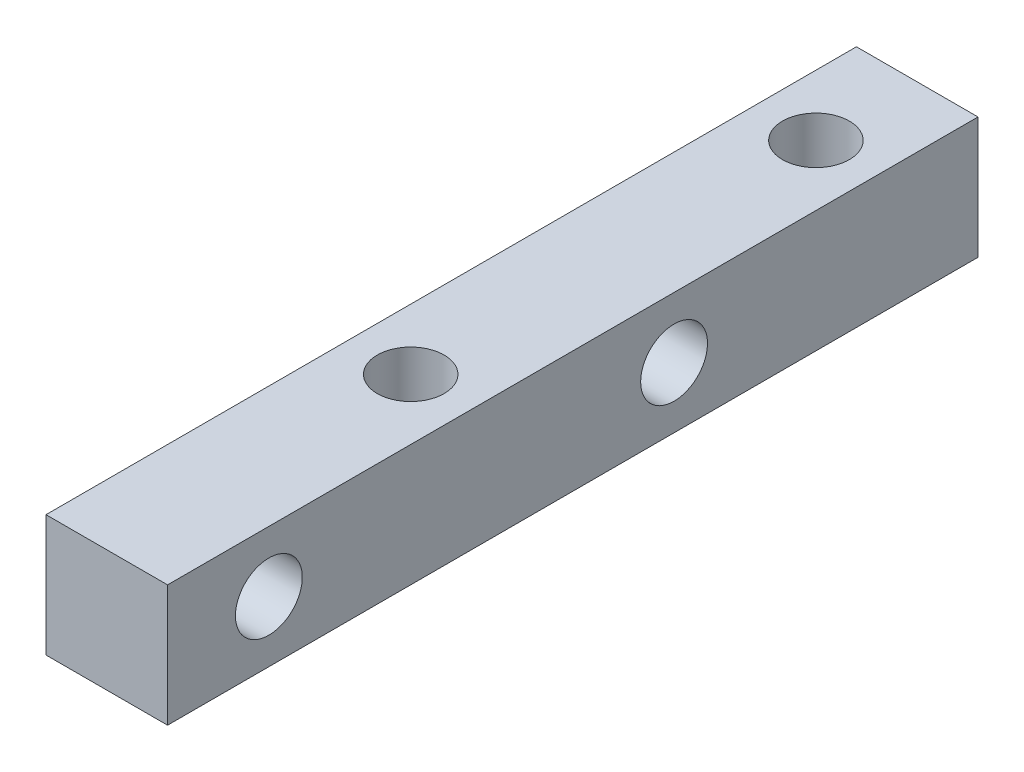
ISO-10303-21;
HEADER;
FILE_DESCRIPTION(('STEP AP214'),'2;1');
FILE_NAME('part.step','',(''),(''),'','','');
FILE_SCHEMA(('AUTOMOTIVE_DESIGN { 1 0 10303 214 1 1 1 1 }'));
ENDSEC;
DATA;
#1=APPLICATION_CONTEXT('core data for automotive mechanical design processes');
#2=APPLICATION_PROTOCOL_DEFINITION('international standard','automotive_design',2000,#1);
#3=PRODUCT_CONTEXT('',#1,'mechanical');
#4=PRODUCT('Part','Part','',(#3));
#5=PRODUCT_RELATED_PRODUCT_CATEGORY('part','',(#4));
#6=PRODUCT_DEFINITION_FORMATION('','',#4);
#7=PRODUCT_DEFINITION_CONTEXT('part definition',#1,'design');
#8=PRODUCT_DEFINITION('design','',#6,#7);
#9=PRODUCT_DEFINITION_SHAPE('','',#8);
#10=(LENGTH_UNIT() NAMED_UNIT(*) SI_UNIT(.MILLI.,.METRE.));
#11=(NAMED_UNIT(*) PLANE_ANGLE_UNIT() SI_UNIT($,.RADIAN.));
#12=(NAMED_UNIT(*) SI_UNIT($,.STERADIAN.) SOLID_ANGLE_UNIT());
#13=UNCERTAINTY_MEASURE_WITH_UNIT(LENGTH_MEASURE(1.E-05),#10,'distance_accuracy_value','');
#14=(GEOMETRIC_REPRESENTATION_CONTEXT(3) GLOBAL_UNCERTAINTY_ASSIGNED_CONTEXT((#13)) GLOBAL_UNIT_ASSIGNED_CONTEXT((#10,
#11,#12)) REPRESENTATION_CONTEXT('',''));
#15=CARTESIAN_POINT('',(0.,0.,0.));
#16=DIRECTION('',(0.,0.,1.));
#17=DIRECTION('',(1.,0.,0.));
#18=AXIS2_PLACEMENT_3D('',#15,#16,#17);
#19=CARTESIAN_POINT('',(0.,0.,0.));
#20=DIRECTION('',(0.,0.,-1.));
#21=DIRECTION('',(0.,-1.,0.));
#22=AXIS2_PLACEMENT_3D('',#19,#20,#21);
#23=PLANE('',#22);
#24=DIRECTION('',(0.,-1.,0.));
#25=VECTOR('',#24,1.);
#26=CARTESIAN_POINT('',(0.,0.,0.));
#27=LINE('',#26,#25);
#28=CARTESIAN_POINT('',(0.,6.,0.));
#29=VERTEX_POINT('',#28);
#30=CARTESIAN_POINT('',(0.,0.,0.));
#31=VERTEX_POINT('',#30);
#32=EDGE_CURVE('E74',#29,#31,#27,.T.);
#33=ORIENTED_EDGE('',*,*,#32,.F.);
#34=DIRECTION('',(-1.,0.,0.));
#35=VECTOR('',#34,1.);
#36=CARTESIAN_POINT('',(0.,6.,0.));
#37=LINE('',#36,#35);
#38=CARTESIAN_POINT('',(6.,6.,0.));
#39=VERTEX_POINT('',#38);
#40=EDGE_CURVE('E26',#39,#29,#37,.T.);
#41=ORIENTED_EDGE('',*,*,#40,.F.);
#42=DIRECTION('',(0.,1.,0.));
#43=VECTOR('',#42,1.);
#44=CARTESIAN_POINT('',(6.,0.,0.));
#45=LINE('',#44,#43);
#46=CARTESIAN_POINT('',(6.,0.,0.));
#47=VERTEX_POINT('',#46);
#48=EDGE_CURVE('E76',#47,#39,#45,.T.);
#49=ORIENTED_EDGE('',*,*,#48,.F.);
#50=DIRECTION('',(1.,0.,0.));
#51=VECTOR('',#50,1.);
#52=CARTESIAN_POINT('',(0.,0.,0.));
#53=LINE('',#52,#51);
#54=EDGE_CURVE('E71',#31,#47,#53,.T.);
#55=ORIENTED_EDGE('',*,*,#54,.F.);
#56=EDGE_LOOP('',(#33,#41,#49,#55));
#57=FACE_BOUND('',#56,.T.);
#58=ADVANCED_FACE('F17',(#57),#23,.T.);
#59=CARTESIAN_POINT('',(0.,0.,40.));
#60=DIRECTION('',(0.,0.,-1.));
#61=DIRECTION('',(0.,-1.,0.));
#62=AXIS2_PLACEMENT_3D('',#59,#60,#61);
#63=PLANE('',#62);
#64=DIRECTION('',(0.,-1.,0.));
#65=VECTOR('',#64,1.);
#66=CARTESIAN_POINT('',(0.,0.,40.));
#67=LINE('',#66,#65);
#68=CARTESIAN_POINT('',(0.,6.,40.));
#69=VERTEX_POINT('',#68);
#70=CARTESIAN_POINT('',(0.,0.,40.));
#71=VERTEX_POINT('',#70);
#72=EDGE_CURVE('E93',#69,#71,#67,.T.);
#73=ORIENTED_EDGE('',*,*,#72,.T.);
#74=DIRECTION('',(1.,0.,0.));
#75=VECTOR('',#74,1.);
#76=CARTESIAN_POINT('',(0.,0.,40.));
#77=LINE('',#76,#75);
#78=CARTESIAN_POINT('',(6.,0.,40.));
#79=VERTEX_POINT('',#78);
#80=EDGE_CURVE('E88',#71,#79,#77,.T.);
#81=ORIENTED_EDGE('',*,*,#80,.T.);
#82=DIRECTION('',(0.,1.,0.));
#83=VECTOR('',#82,1.);
#84=CARTESIAN_POINT('',(6.,0.,40.));
#85=LINE('',#84,#83);
#86=CARTESIAN_POINT('',(6.,6.,40.));
#87=VERTEX_POINT('',#86);
#88=EDGE_CURVE('E118',#79,#87,#85,.T.);
#89=ORIENTED_EDGE('',*,*,#88,.T.);
#90=DIRECTION('',(-1.,0.,0.));
#91=VECTOR('',#90,1.);
#92=CARTESIAN_POINT('',(0.,6.,40.));
#93=LINE('',#92,#91);
#94=EDGE_CURVE('E11',#87,#69,#93,.T.);
#95=ORIENTED_EDGE('',*,*,#94,.T.);
#96=EDGE_LOOP('',(#73,#81,#89,#95));
#97=FACE_BOUND('',#96,.T.);
#98=ADVANCED_FACE('F19',(#97),#63,.F.);
#99=CARTESIAN_POINT('',(0.,6.,40.));
#100=DIRECTION('',(0.,-1.,0.));
#101=DIRECTION('',(0.,0.,-1.));
#102=AXIS2_PLACEMENT_3D('',#99,#100,#101);
#103=PLANE('',#102);
#104=CARTESIAN_POINT('',(3.,6.,25.));
#105=DIRECTION('',(0.,1.,0.));
#106=DIRECTION('',(0.,0.,1.));
#107=AXIS2_PLACEMENT_3D('',#104,#105,#106);
#108=CIRCLE('',#107,1.65);
#109=CARTESIAN_POINT('',(3.,6.,26.65));
#110=VERTEX_POINT('',#109);
#111=EDGE_CURVE('E98',#110,#110,#108,.T.);
#112=ORIENTED_EDGE('',*,*,#111,.F.);
#113=EDGE_LOOP('',(#112));
#114=FACE_BOUND('',#113,.T.);
#115=CARTESIAN_POINT('',(3.,6.,5.));
#116=DIRECTION('',(0.,1.,0.));
#117=DIRECTION('',(0.,0.,1.));
#118=AXIS2_PLACEMENT_3D('',#115,#116,#117);
#119=CIRCLE('',#118,1.65);
#120=CARTESIAN_POINT('',(3.,6.,6.65));
#121=VERTEX_POINT('',#120);
#122=EDGE_CURVE('E109',#121,#121,#119,.T.);
#123=ORIENTED_EDGE('',*,*,#122,.F.);
#124=EDGE_LOOP('',(#123));
#125=FACE_BOUND('',#124,.T.);
#126=ORIENTED_EDGE('',*,*,#40,.T.);
#127=DIRECTION('',(0.,0.,-1.));
#128=VECTOR('',#127,1.);
#129=CARTESIAN_POINT('',(0.,6.,40.));
#130=LINE('',#129,#128);
#131=EDGE_CURVE('E82',#69,#29,#130,.T.);
#132=ORIENTED_EDGE('',*,*,#131,.F.);
#133=ORIENTED_EDGE('',*,*,#94,.F.);
#134=DIRECTION('',(0.,0.,-1.));
#135=VECTOR('',#134,1.);
#136=CARTESIAN_POINT('',(6.,6.,40.));
#137=LINE('',#136,#135);
#138=EDGE_CURVE('E116',#87,#39,#137,.T.);
#139=ORIENTED_EDGE('',*,*,#138,.T.);
#140=EDGE_LOOP('',(#126,#132,#133,#139));
#141=FACE_BOUND('',#140,.T.);
#142=ADVANCED_FACE('F130',(#114,#125,#141),#103,.F.);
#143=CARTESIAN_POINT('',(6.,0.,40.));
#144=DIRECTION('',(-1.,0.,0.));
#145=DIRECTION('',(0.,0.,1.));
#146=AXIS2_PLACEMENT_3D('',#143,#144,#145);
#147=PLANE('',#146);
#148=CARTESIAN_POINT('',(6.,3.,15.));
#149=DIRECTION('',(-1.,0.,0.));
#150=DIRECTION('',(0.,0.,1.));
#151=AXIS2_PLACEMENT_3D('',#148,#149,#150);
#152=CIRCLE('',#151,1.65);
#153=CARTESIAN_POINT('',(6.,3.,16.65));
#154=VERTEX_POINT('',#153);
#155=EDGE_CURVE('E157',#154,#154,#152,.T.);
#156=ORIENTED_EDGE('',*,*,#155,.T.);
#157=EDGE_LOOP('',(#156));
#158=FACE_BOUND('',#157,.T.);
#159=CARTESIAN_POINT('',(6.,3.,35.));
#160=DIRECTION('',(-1.,0.,0.));
#161=DIRECTION('',(0.,0.,1.));
#162=AXIS2_PLACEMENT_3D('',#159,#160,#161);
#163=CIRCLE('',#162,1.65);
#164=CARTESIAN_POINT('',(6.,3.,36.65));
#165=VERTEX_POINT('',#164);
#166=EDGE_CURVE('E160',#165,#165,#163,.T.);
#167=ORIENTED_EDGE('',*,*,#166,.T.);
#168=EDGE_LOOP('',(#167));
#169=FACE_BOUND('',#168,.T.);
#170=ORIENTED_EDGE('',*,*,#48,.T.);
#171=ORIENTED_EDGE('',*,*,#138,.F.);
#172=ORIENTED_EDGE('',*,*,#88,.F.);
#173=DIRECTION('',(0.,0.,-1.));
#174=VECTOR('',#173,1.);
#175=CARTESIAN_POINT('',(6.,0.,40.));
#176=LINE('',#175,#174);
#177=EDGE_CURVE('E81',#79,#47,#176,.T.);
#178=ORIENTED_EDGE('',*,*,#177,.T.);
#179=EDGE_LOOP('',(#170,#171,#172,#178));
#180=FACE_BOUND('',#179,.T.);
#181=ADVANCED_FACE('F133',(#158,#169,#180),#147,.F.);
#182=CARTESIAN_POINT('',(0.,0.,40.));
#183=DIRECTION('',(0.,1.,0.));
#184=DIRECTION('',(1.,0.,0.));
#185=AXIS2_PLACEMENT_3D('',#182,#183,#184);
#186=PLANE('',#185);
#187=CARTESIAN_POINT('',(3.,0.,25.));
#188=DIRECTION('',(0.,1.,0.));
#189=DIRECTION('',(0.,0.,1.));
#190=AXIS2_PLACEMENT_3D('',#187,#188,#189);
#191=CIRCLE('',#190,1.65);
#192=CARTESIAN_POINT('',(3.,0.,26.65));
#193=VERTEX_POINT('',#192);
#194=EDGE_CURVE('E106',#193,#193,#191,.T.);
#195=ORIENTED_EDGE('',*,*,#194,.T.);
#196=EDGE_LOOP('',(#195));
#197=FACE_BOUND('',#196,.T.);
#198=CARTESIAN_POINT('',(3.,0.,5.));
#199=DIRECTION('',(0.,1.,0.));
#200=DIRECTION('',(0.,0.,1.));
#201=AXIS2_PLACEMENT_3D('',#198,#199,#200);
#202=CIRCLE('',#201,1.65);
#203=CARTESIAN_POINT('',(3.,0.,6.65));
#204=VERTEX_POINT('',#203);
#205=EDGE_CURVE('E179',#204,#204,#202,.T.);
#206=ORIENTED_EDGE('',*,*,#205,.T.);
#207=EDGE_LOOP('',(#206));
#208=FACE_BOUND('',#207,.T.);
#209=ORIENTED_EDGE('',*,*,#54,.T.);
#210=ORIENTED_EDGE('',*,*,#177,.F.);
#211=ORIENTED_EDGE('',*,*,#80,.F.);
#212=DIRECTION('',(0.,0.,-1.));
#213=VECTOR('',#212,1.);
#214=CARTESIAN_POINT('',(0.,0.,40.));
#215=LINE('',#214,#213);
#216=EDGE_CURVE('E85',#71,#31,#215,.T.);
#217=ORIENTED_EDGE('',*,*,#216,.T.);
#218=EDGE_LOOP('',(#209,#210,#211,#217));
#219=FACE_BOUND('',#218,.T.);
#220=ADVANCED_FACE('F86',(#197,#208,#219),#186,.F.);
#221=CARTESIAN_POINT('',(0.,0.,40.));
#222=DIRECTION('',(1.,0.,0.));
#223=DIRECTION('',(0.,1.,0.));
#224=AXIS2_PLACEMENT_3D('',#221,#222,#223);
#225=PLANE('',#224);
#226=CARTESIAN_POINT('',(0.,3.,15.));
#227=DIRECTION('',(-1.,0.,0.));
#228=DIRECTION('',(0.,0.,1.));
#229=AXIS2_PLACEMENT_3D('',#226,#227,#228);
#230=CIRCLE('',#229,1.65);
#231=CARTESIAN_POINT('',(0.,3.,16.65));
#232=VERTEX_POINT('',#231);
#233=EDGE_CURVE('E173',#232,#232,#230,.T.);
#234=ORIENTED_EDGE('',*,*,#233,.F.);
#235=EDGE_LOOP('',(#234));
#236=FACE_BOUND('',#235,.T.);
#237=CARTESIAN_POINT('',(0.,3.,35.));
#238=DIRECTION('',(-1.,0.,0.));
#239=DIRECTION('',(0.,0.,1.));
#240=AXIS2_PLACEMENT_3D('',#237,#238,#239);
#241=CIRCLE('',#240,1.65);
#242=CARTESIAN_POINT('',(0.,3.,36.65));
#243=VERTEX_POINT('',#242);
#244=EDGE_CURVE('E163',#243,#243,#241,.T.);
#245=ORIENTED_EDGE('',*,*,#244,.F.);
#246=EDGE_LOOP('',(#245));
#247=FACE_BOUND('',#246,.T.);
#248=ORIENTED_EDGE('',*,*,#32,.T.);
#249=ORIENTED_EDGE('',*,*,#216,.F.);
#250=ORIENTED_EDGE('',*,*,#72,.F.);
#251=ORIENTED_EDGE('',*,*,#131,.T.);
#252=EDGE_LOOP('',(#248,#249,#250,#251));
#253=FACE_BOUND('',#252,.T.);
#254=ADVANCED_FACE('F96',(#236,#247,#253),#225,.F.);
#255=CARTESIAN_POINT('',(3.,-44.,25.));
#256=DIRECTION('',(0.,1.,0.));
#257=DIRECTION('',(0.,0.,1.));
#258=AXIS2_PLACEMENT_3D('',#255,#256,#257);
#259=CYLINDRICAL_SURFACE('',#258,1.65);
#260=ORIENTED_EDGE('',*,*,#111,.T.);
#261=EDGE_LOOP('',(#260));
#262=FACE_BOUND('',#261,.T.);
#263=ORIENTED_EDGE('',*,*,#194,.F.);
#264=EDGE_LOOP('',(#263));
#265=FACE_BOUND('',#264,.T.);
#266=ADVANCED_FACE('F197',(#262,#265),#259,.F.);
#267=CARTESIAN_POINT('',(3.,-44.,5.));
#268=DIRECTION('',(0.,1.,0.));
#269=DIRECTION('',(0.,0.,1.));
#270=AXIS2_PLACEMENT_3D('',#267,#268,#269);
#271=CYLINDRICAL_SURFACE('',#270,1.65);
#272=ORIENTED_EDGE('',*,*,#122,.T.);
#273=EDGE_LOOP('',(#272));
#274=FACE_BOUND('',#273,.T.);
#275=ORIENTED_EDGE('',*,*,#205,.F.);
#276=EDGE_LOOP('',(#275));
#277=FACE_BOUND('',#276,.T.);
#278=ADVANCED_FACE('F192',(#274,#277),#271,.F.);
#279=CARTESIAN_POINT('',(50.,3.,15.));
#280=DIRECTION('',(-1.,0.,0.));
#281=DIRECTION('',(0.,0.,1.));
#282=AXIS2_PLACEMENT_3D('',#279,#280,#281);
#283=CYLINDRICAL_SURFACE('',#282,1.65);
#284=ORIENTED_EDGE('',*,*,#233,.T.);
#285=EDGE_LOOP('',(#284));
#286=FACE_BOUND('',#285,.T.);
#287=ORIENTED_EDGE('',*,*,#155,.F.);
#288=EDGE_LOOP('',(#287));
#289=FACE_BOUND('',#288,.T.);
#290=ADVANCED_FACE('F196',(#286,#289),#283,.F.);
#291=CARTESIAN_POINT('',(50.,3.,35.));
#292=DIRECTION('',(-1.,0.,0.));
#293=DIRECTION('',(0.,0.,1.));
#294=AXIS2_PLACEMENT_3D('',#291,#292,#293);
#295=CYLINDRICAL_SURFACE('',#294,1.65);
#296=ORIENTED_EDGE('',*,*,#244,.T.);
#297=EDGE_LOOP('',(#296));
#298=FACE_BOUND('',#297,.T.);
#299=ORIENTED_EDGE('',*,*,#166,.F.);
#300=EDGE_LOOP('',(#299));
#301=FACE_BOUND('',#300,.T.);
#302=ADVANCED_FACE('F203',(#298,#301),#295,.F.);
#303=CLOSED_SHELL('',(#58,#98,#142,#181,#220,#254,#266,#278,#290,#302));
#304=MANIFOLD_SOLID_BREP('B1',#303);
#305=ADVANCED_BREP_SHAPE_REPRESENTATION('',(#18,#304),#14);
#306=SHAPE_DEFINITION_REPRESENTATION(#9,#305);
ENDSEC;
END-ISO-10303-21;
